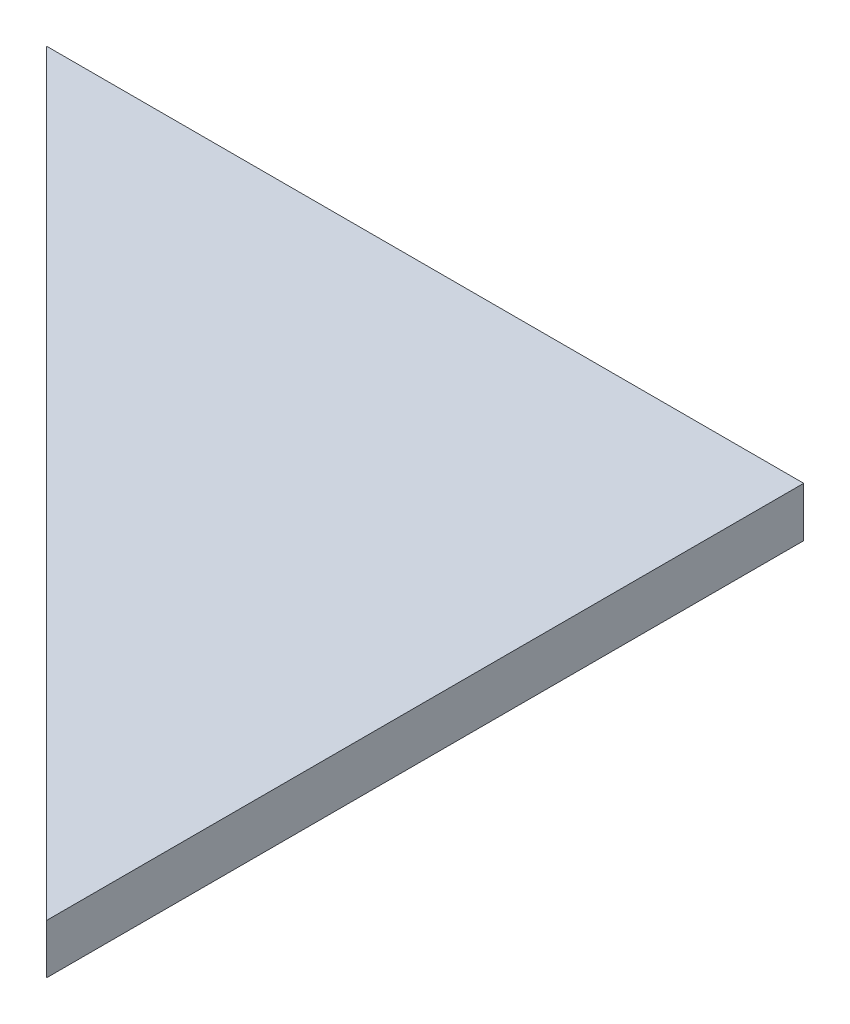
ISO-10303-21;
HEADER;
FILE_DESCRIPTION(('STEP AP214'),'2;1');
FILE_NAME('part.step','',(''),(''),'','','');
FILE_SCHEMA(('AUTOMOTIVE_DESIGN { 1 0 10303 214 1 1 1 1 }'));
ENDSEC;
DATA;
#1=APPLICATION_CONTEXT('core data for automotive mechanical design processes');
#2=APPLICATION_PROTOCOL_DEFINITION('international standard','automotive_design',2000,#1);
#3=PRODUCT_CONTEXT('',#1,'mechanical');
#4=PRODUCT('Part','Part','',(#3));
#5=PRODUCT_RELATED_PRODUCT_CATEGORY('part','',(#4));
#6=PRODUCT_DEFINITION_FORMATION('','',#4);
#7=PRODUCT_DEFINITION_CONTEXT('part definition',#1,'design');
#8=PRODUCT_DEFINITION('design','',#6,#7);
#9=PRODUCT_DEFINITION_SHAPE('','',#8);
#10=(LENGTH_UNIT() NAMED_UNIT(*) SI_UNIT(.MILLI.,.METRE.));
#11=(NAMED_UNIT(*) PLANE_ANGLE_UNIT() SI_UNIT($,.RADIAN.));
#12=(NAMED_UNIT(*) SI_UNIT($,.STERADIAN.) SOLID_ANGLE_UNIT());
#13=UNCERTAINTY_MEASURE_WITH_UNIT(LENGTH_MEASURE(1.E-05),#10,'distance_accuracy_value','');
#14=(GEOMETRIC_REPRESENTATION_CONTEXT(3) GLOBAL_UNCERTAINTY_ASSIGNED_CONTEXT((#13)) GLOBAL_UNIT_ASSIGNED_CONTEXT((#10,
#11,#12)) REPRESENTATION_CONTEXT('',''));
#15=CARTESIAN_POINT('',(0.,0.,0.));
#16=DIRECTION('',(0.,0.,1.));
#17=DIRECTION('',(1.,0.,0.));
#18=AXIS2_PLACEMENT_3D('',#15,#16,#17);
#19=CARTESIAN_POINT('',(-7.61782227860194,10.,7.61782227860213));
#20=DIRECTION('',(0.707106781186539,0.,-0.707106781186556));
#21=DIRECTION('',(-0.707106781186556,0.,-0.707106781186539));
#22=AXIS2_PLACEMENT_3D('',#19,#20,#21);
#23=PLANE('',#22);
#24=DIRECTION('',(0.,1.,0.));
#25=VECTOR('',#24,1.);
#26=CARTESIAN_POINT('',(-15.2356445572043,10.,0.));
#27=LINE('',#26,#25);
#28=CARTESIAN_POINT('',(-15.2356445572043,9.5,0.));
#29=VERTEX_POINT('',#28);
#30=CARTESIAN_POINT('',(-15.2356445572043,10.5,0.));
#31=VERTEX_POINT('',#30);
#32=EDGE_CURVE('E11',#29,#31,#27,.T.);
#33=ORIENTED_EDGE('',*,*,#32,.F.);
#34=DIRECTION('',(-0.707106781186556,0.,-0.707106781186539));
#35=VECTOR('',#34,1.);
#36=CARTESIAN_POINT('',(-7.61782227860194,9.5,7.61782227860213));
#37=LINE('',#36,#35);
#38=CARTESIAN_POINT('',(0.,9.5,15.2356445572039));
#39=VERTEX_POINT('',#38);
#40=EDGE_CURVE('E76',#39,#29,#37,.T.);
#41=ORIENTED_EDGE('',*,*,#40,.F.);
#42=DIRECTION('',(0.,1.,0.));
#43=VECTOR('',#42,1.);
#44=CARTESIAN_POINT('',(0.,10.,15.2356445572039));
#45=LINE('',#44,#43);
#46=CARTESIAN_POINT('',(0.,10.5,15.2356445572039));
#47=VERTEX_POINT('',#46);
#48=EDGE_CURVE('E42',#39,#47,#45,.T.);
#49=ORIENTED_EDGE('',*,*,#48,.T.);
#50=DIRECTION('',(-0.707106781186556,0.,-0.707106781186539));
#51=VECTOR('',#50,1.);
#52=CARTESIAN_POINT('',(-7.61782227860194,10.5,7.61782227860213));
#53=LINE('',#52,#51);
#54=EDGE_CURVE('E71',#47,#31,#53,.T.);
#55=ORIENTED_EDGE('',*,*,#54,.T.);
#56=EDGE_LOOP('',(#33,#41,#49,#55));
#57=FACE_BOUND('',#56,.T.);
#58=ADVANCED_FACE('F32',(#57),#23,.F.);
#59=CARTESIAN_POINT('',(0.,10.,0.));
#60=DIRECTION('',(-1.,0.,0.));
#61=DIRECTION('',(0.,0.,1.));
#62=AXIS2_PLACEMENT_3D('',#59,#60,#61);
#63=PLANE('',#62);
#64=ORIENTED_EDGE('',*,*,#48,.F.);
#65=DIRECTION('',(0.,0.,1.));
#66=VECTOR('',#65,1.);
#67=CARTESIAN_POINT('',(0.,9.5,0.));
#68=LINE('',#67,#66);
#69=CARTESIAN_POINT('',(0.,9.5,0.));
#70=VERTEX_POINT('',#69);
#71=EDGE_CURVE('E75',#39,#70,#68,.F.);
#72=ORIENTED_EDGE('',*,*,#71,.T.);
#73=DIRECTION('',(0.,1.,0.));
#74=VECTOR('',#73,1.);
#75=CARTESIAN_POINT('',(0.,10.,0.));
#76=LINE('',#75,#74);
#77=CARTESIAN_POINT('',(0.,10.5,0.));
#78=VERTEX_POINT('',#77);
#79=EDGE_CURVE('E36',#70,#78,#76,.T.);
#80=ORIENTED_EDGE('',*,*,#79,.T.);
#81=DIRECTION('',(0.,0.,1.));
#82=VECTOR('',#81,1.);
#83=CARTESIAN_POINT('',(0.,10.5,0.));
#84=LINE('',#83,#82);
#85=EDGE_CURVE('E83',#47,#78,#84,.F.);
#86=ORIENTED_EDGE('',*,*,#85,.F.);
#87=EDGE_LOOP('',(#64,#72,#80,#86));
#88=FACE_BOUND('',#87,.T.);
#89=ADVANCED_FACE('F78',(#88),#63,.F.);
#90=CARTESIAN_POINT('',(0.,10.,0.));
#91=DIRECTION('',(0.,0.,1.));
#92=DIRECTION('',(1.,0.,0.));
#93=AXIS2_PLACEMENT_3D('',#90,#91,#92);
#94=PLANE('',#93);
#95=DIRECTION('',(1.,0.,0.));
#96=VECTOR('',#95,1.);
#97=CARTESIAN_POINT('',(0.,9.5,0.));
#98=LINE('',#97,#96);
#99=EDGE_CURVE('E64',#70,#29,#98,.F.);
#100=ORIENTED_EDGE('',*,*,#99,.T.);
#101=ORIENTED_EDGE('',*,*,#32,.T.);
#102=DIRECTION('',(1.,0.,0.));
#103=VECTOR('',#102,1.);
#104=CARTESIAN_POINT('',(0.,10.5,0.));
#105=LINE('',#104,#103);
#106=EDGE_CURVE('E67',#78,#31,#105,.F.);
#107=ORIENTED_EDGE('',*,*,#106,.F.);
#108=ORIENTED_EDGE('',*,*,#79,.F.);
#109=EDGE_LOOP('',(#100,#101,#107,#108));
#110=FACE_BOUND('',#109,.T.);
#111=ADVANCED_FACE('F34',(#110),#94,.F.);
#112=CARTESIAN_POINT('',(0.,10.5,0.));
#113=DIRECTION('',(0.,1.,0.));
#114=DIRECTION('',(0.,0.,1.));
#115=AXIS2_PLACEMENT_3D('',#112,#113,#114);
#116=PLANE('',#115);
#117=ORIENTED_EDGE('',*,*,#85,.T.);
#118=ORIENTED_EDGE('',*,*,#106,.T.);
#119=ORIENTED_EDGE('',*,*,#54,.F.);
#120=EDGE_LOOP('',(#117,#118,#119));
#121=FACE_BOUND('',#120,.T.);
#122=ADVANCED_FACE('F88',(#121),#116,.T.);
#123=CARTESIAN_POINT('',(0.,9.5,0.));
#124=DIRECTION('',(0.,1.,0.));
#125=DIRECTION('',(0.,0.,1.));
#126=AXIS2_PLACEMENT_3D('',#123,#124,#125);
#127=PLANE('',#126);
#128=ORIENTED_EDGE('',*,*,#71,.F.);
#129=ORIENTED_EDGE('',*,*,#40,.T.);
#130=ORIENTED_EDGE('',*,*,#99,.F.);
#131=EDGE_LOOP('',(#128,#129,#130));
#132=FACE_BOUND('',#131,.T.);
#133=ADVANCED_FACE('F74',(#132),#127,.F.);
#134=CLOSED_SHELL('',(#58,#89,#111,#122,#133));
#135=MANIFOLD_SOLID_BREP('B2',#134);
#136=ADVANCED_BREP_SHAPE_REPRESENTATION('',(#18,#135),#14);
#137=SHAPE_DEFINITION_REPRESENTATION(#9,#136);
ENDSEC;
END-ISO-10303-21;
